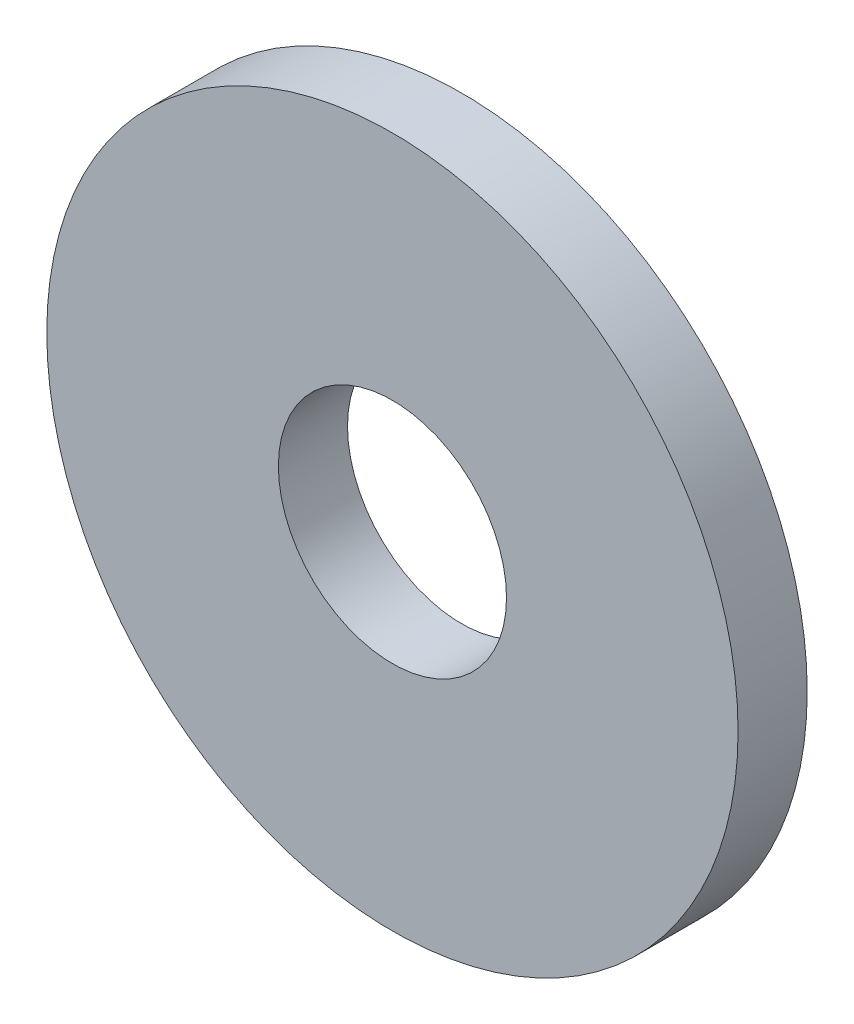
ISO-10303-21;
HEADER;
FILE_DESCRIPTION(('STEP AP214'),'2;1');
FILE_NAME('part.step','',(''),(''),'','','');
FILE_SCHEMA(('AUTOMOTIVE_DESIGN { 1 0 10303 214 1 1 1 1 }'));
ENDSEC;
DATA;
#1=APPLICATION_CONTEXT('core data for automotive mechanical design processes');
#2=APPLICATION_PROTOCOL_DEFINITION('international standard','automotive_design',2000,#1);
#3=PRODUCT_CONTEXT('',#1,'mechanical');
#4=PRODUCT('Part','Part','',(#3));
#5=PRODUCT_RELATED_PRODUCT_CATEGORY('part','',(#4));
#6=PRODUCT_DEFINITION_FORMATION('','',#4);
#7=PRODUCT_DEFINITION_CONTEXT('part definition',#1,'design');
#8=PRODUCT_DEFINITION('design','',#6,#7);
#9=PRODUCT_DEFINITION_SHAPE('','',#8);
#10=(LENGTH_UNIT() NAMED_UNIT(*) SI_UNIT(.MILLI.,.METRE.));
#11=(NAMED_UNIT(*) PLANE_ANGLE_UNIT() SI_UNIT($,.RADIAN.));
#12=(NAMED_UNIT(*) SI_UNIT($,.STERADIAN.) SOLID_ANGLE_UNIT());
#13=UNCERTAINTY_MEASURE_WITH_UNIT(LENGTH_MEASURE(1.E-05),#10,'distance_accuracy_value','');
#14=(GEOMETRIC_REPRESENTATION_CONTEXT(3) GLOBAL_UNCERTAINTY_ASSIGNED_CONTEXT((#13)) GLOBAL_UNIT_ASSIGNED_CONTEXT((#10,
#11,#12)) REPRESENTATION_CONTEXT('',''));
#15=CARTESIAN_POINT('',(0.,0.,0.));
#16=DIRECTION('',(0.,0.,1.));
#17=DIRECTION('',(1.,0.,0.));
#18=AXIS2_PLACEMENT_3D('',#15,#16,#17);
#19=CARTESIAN_POINT('',(0.,0.,1.));
#20=DIRECTION('',(0.,0.,1.));
#21=DIRECTION('',(1.,0.,0.));
#22=AXIS2_PLACEMENT_3D('',#19,#20,#21);
#23=PLANE('',#22);
#24=CARTESIAN_POINT('',(0.,0.,1.));
#25=DIRECTION('',(0.,0.,1.));
#26=DIRECTION('',(1.,0.,0.));
#27=AXIS2_PLACEMENT_3D('',#24,#25,#26);
#28=CIRCLE('',#27,1.65);
#29=CARTESIAN_POINT('',(1.65000000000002,0.,1.));
#30=VERTEX_POINT('',#29);
#31=EDGE_CURVE('E21',#30,#30,#28,.T.);
#32=ORIENTED_EDGE('',*,*,#31,.F.);
#33=EDGE_LOOP('',(#32));
#34=FACE_BOUND('',#33,.T.);
#35=CARTESIAN_POINT('',(0.,0.,1.));
#36=DIRECTION('',(0.,0.,1.));
#37=DIRECTION('',(1.,0.,0.));
#38=AXIS2_PLACEMENT_3D('',#35,#36,#37);
#39=CIRCLE('',#38,5.);
#40=CARTESIAN_POINT('',(5.,0.,1.));
#41=VERTEX_POINT('',#40);
#42=EDGE_CURVE('E26',#41,#41,#39,.T.);
#43=ORIENTED_EDGE('',*,*,#42,.T.);
#44=EDGE_LOOP('',(#43));
#45=FACE_BOUND('',#44,.T.);
#46=ADVANCED_FACE('F14',(#34,#45),#23,.T.);
#47=CARTESIAN_POINT('',(0.,0.,0.));
#48=DIRECTION('',(0.,0.,1.));
#49=DIRECTION('',(1.,0.,0.));
#50=AXIS2_PLACEMENT_3D('',#47,#48,#49);
#51=PLANE('',#50);
#52=CARTESIAN_POINT('',(0.,0.,0.));
#53=DIRECTION('',(0.,0.,1.));
#54=DIRECTION('',(1.,0.,0.));
#55=AXIS2_PLACEMENT_3D('',#52,#53,#54);
#56=CIRCLE('',#55,1.65);
#57=CARTESIAN_POINT('',(1.65000000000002,0.,0.));
#58=VERTEX_POINT('',#57);
#59=EDGE_CURVE('E9',#58,#58,#56,.T.);
#60=ORIENTED_EDGE('',*,*,#59,.T.);
#61=EDGE_LOOP('',(#60));
#62=FACE_BOUND('',#61,.T.);
#63=CARTESIAN_POINT('',(0.,0.,0.));
#64=DIRECTION('',(0.,0.,1.));
#65=DIRECTION('',(1.,0.,0.));
#66=AXIS2_PLACEMENT_3D('',#63,#64,#65);
#67=CIRCLE('',#66,5.);
#68=CARTESIAN_POINT('',(5.,0.,0.));
#69=VERTEX_POINT('',#68);
#70=EDGE_CURVE('E34',#69,#69,#67,.T.);
#71=ORIENTED_EDGE('',*,*,#70,.F.);
#72=EDGE_LOOP('',(#71));
#73=FACE_BOUND('',#72,.T.);
#74=ADVANCED_FACE('F44',(#62,#73),#51,.F.);
#75=CARTESIAN_POINT('',(0.,0.,0.));
#76=DIRECTION('',(0.,0.,-1.));
#77=DIRECTION('',(1.,0.,0.));
#78=AXIS2_PLACEMENT_3D('',#75,#76,#77);
#79=CYLINDRICAL_SURFACE('',#78,1.65);
#80=ORIENTED_EDGE('',*,*,#31,.T.);
#81=EDGE_LOOP('',(#80));
#82=FACE_BOUND('',#81,.T.);
#83=ORIENTED_EDGE('',*,*,#59,.F.);
#84=EDGE_LOOP('',(#83));
#85=FACE_BOUND('',#84,.T.);
#86=ADVANCED_FACE('F50',(#82,#85),#79,.F.);
#87=CARTESIAN_POINT('',(0.,0.,0.));
#88=DIRECTION('',(0.,0.,-1.));
#89=DIRECTION('',(1.,0.,0.));
#90=AXIS2_PLACEMENT_3D('',#87,#88,#89);
#91=CYLINDRICAL_SURFACE('',#90,5.);
#92=ORIENTED_EDGE('',*,*,#42,.F.);
#93=EDGE_LOOP('',(#92));
#94=FACE_BOUND('',#93,.T.);
#95=ORIENTED_EDGE('',*,*,#70,.T.);
#96=EDGE_LOOP('',(#95));
#97=FACE_BOUND('',#96,.T.);
#98=ADVANCED_FACE('F43',(#94,#97),#91,.T.);
#99=CLOSED_SHELL('',(#46,#74,#86,#98));
#100=MANIFOLD_SOLID_BREP('B1',#99);
#101=ADVANCED_BREP_SHAPE_REPRESENTATION('',(#18,#100),#14);
#102=SHAPE_DEFINITION_REPRESENTATION(#9,#101);
ENDSEC;
END-ISO-10303-21;
